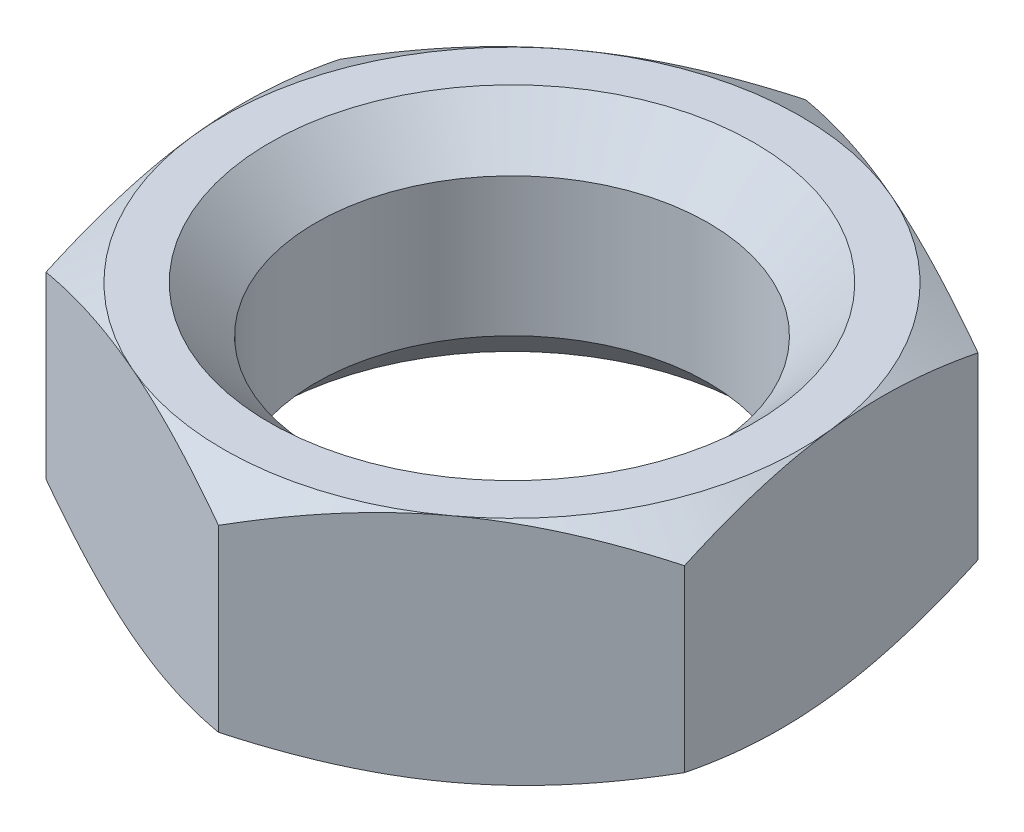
ISO-10303-21;
HEADER;
FILE_DESCRIPTION(('STEP AP214'),'2;1');
FILE_NAME('part.step','',(''),(''),'','','');
FILE_SCHEMA(('AUTOMOTIVE_DESIGN { 1 0 10303 214 1 1 1 1 }'));
ENDSEC;
DATA;
#1=APPLICATION_CONTEXT('core data for automotive mechanical design processes');
#2=APPLICATION_PROTOCOL_DEFINITION('international standard','automotive_design',2000,#1);
#3=PRODUCT_CONTEXT('',#1,'mechanical');
#4=PRODUCT('Part','Part','',(#3));
#5=PRODUCT_RELATED_PRODUCT_CATEGORY('part','',(#4));
#6=PRODUCT_DEFINITION_FORMATION('','',#4);
#7=PRODUCT_DEFINITION_CONTEXT('part definition',#1,'design');
#8=PRODUCT_DEFINITION('design','',#6,#7);
#9=PRODUCT_DEFINITION_SHAPE('','',#8);
#10=(LENGTH_UNIT() NAMED_UNIT(*) SI_UNIT(.MILLI.,.METRE.));
#11=(NAMED_UNIT(*) PLANE_ANGLE_UNIT() SI_UNIT($,.RADIAN.));
#12=(NAMED_UNIT(*) SI_UNIT($,.STERADIAN.) SOLID_ANGLE_UNIT());
#13=UNCERTAINTY_MEASURE_WITH_UNIT(LENGTH_MEASURE(1.E-05),#10,'distance_accuracy_value','');
#14=(GEOMETRIC_REPRESENTATION_CONTEXT(3) GLOBAL_UNCERTAINTY_ASSIGNED_CONTEXT((#13)) GLOBAL_UNIT_ASSIGNED_CONTEXT((#10,
#11,#12)) REPRESENTATION_CONTEXT('',''));
#15=CARTESIAN_POINT('',(0.,0.,0.));
#16=DIRECTION('',(0.,0.,1.));
#17=DIRECTION('',(1.,0.,0.));
#18=AXIS2_PLACEMENT_3D('',#15,#16,#17);
#19=CARTESIAN_POINT('',(-5.29341186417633,4.,-2.30502151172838));
#20=DIRECTION('',(0.993632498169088,0.,-0.112669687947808));
#21=DIRECTION('',(-0.112669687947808,0.,-0.993632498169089));
#22=AXIS2_PLACEMENT_3D('',#19,#20,#21);
#23=PLANE('',#22);
#24=CARTESIAN_POINT('',(-5.29343454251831,3.55335990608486,-2.30522151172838));
#25=CARTESIAN_POINT('',(-5.26484718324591,3.62662129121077,-2.05310996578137));
#26=CARTESIAN_POINT('',(-5.23601531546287,3.69325579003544,-1.79884210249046));
#27=CARTESIAN_POINT('',(-5.17785233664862,3.80956657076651,-1.28590355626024));
#28=CARTESIAN_POINT('',(-5.14852019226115,3.85920170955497,-1.02722376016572));
#29=CARTESIAN_POINT('',(-5.09021494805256,3.93645214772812,-0.513030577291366));
#30=CARTESIAN_POINT('',(-5.0612509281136,3.9645820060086,-0.257597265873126));
#31=CARTESIAN_POINT('',(-5.01770301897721,3.98980631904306,0.126451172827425));
#32=CARTESIAN_POINT('',(-5.00317711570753,3.99538740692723,0.254554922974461));
#33=CARTESIAN_POINT('',(-4.97411188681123,4.00079792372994,0.510880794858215));
#34=CARTESIAN_POINT('',(-4.95957256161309,4.00062753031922,0.639102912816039));
#35=CARTESIAN_POINT('',(-4.91973930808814,3.99224532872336,0.990391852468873));
#36=CARTESIAN_POINT('',(-4.89445858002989,3.97816904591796,1.21334226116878));
#37=CARTESIAN_POINT('',(-4.84406490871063,3.93353394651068,1.65776338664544));
#38=CARTESIAN_POINT('',(-4.81895214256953,3.90295987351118,1.87923254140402));
#39=CARTESIAN_POINT('',(-4.76845694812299,3.82653289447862,2.32454899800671));
#40=CARTESIAN_POINT('',(-4.74308089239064,3.78035615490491,2.54834010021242));
#41=CARTESIAN_POINT('',(-4.69270721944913,3.67555346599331,2.99258486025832));
#42=CARTESIAN_POINT('',(-4.66770895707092,3.61695213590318,3.21304420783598));
#43=CARTESIAN_POINT('',(-4.64289043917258,3.55335990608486,3.43191839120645));
#44=B_SPLINE_CURVE_WITH_KNOTS('',3,(#24,#25,#26,#27,#28,#29,#30,#31,#32,#33,#34,#35,#36,#37,#38,
#39,#40,#41,#42,#43),.UNSPECIFIED.,.F.,.F.,(4,2,2,2,2,2,2,2,2,4),(0.,0.792553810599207,
1.58701248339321,2.36180942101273,2.74883389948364,3.13584642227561,3.80960273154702,
4.48398317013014,5.17332088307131,5.86130523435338),.UNSPECIFIED.);
#45=CARTESIAN_POINT('',(-5.29341186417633,3.55341801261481,-2.30502151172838));
#46=VERTEX_POINT('',#45);
#47=CARTESIAN_POINT('',(-4.96816249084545,4.,0.563348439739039));
#48=VERTEX_POINT('',#47);
#49=EDGE_CURVE('E767',#46,#48,#44,.T.);
#50=ORIENTED_EDGE('',*,*,#49,.F.);
#51=DIRECTION('',(0.,-1.,0.));
#52=VECTOR('',#51,1.);
#53=CARTESIAN_POINT('',(-5.29341186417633,4.,-2.30502151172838));
#54=LINE('',#53,#52);
#55=CARTESIAN_POINT('',(-5.29341186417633,0.446581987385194,-2.30502151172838));
#56=VERTEX_POINT('',#55);
#57=EDGE_CURVE('E548',#46,#56,#54,.T.);
#58=ORIENTED_EDGE('',*,*,#57,.T.);
#59=CARTESIAN_POINT('',(-4.64289043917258,0.446640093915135,3.43191839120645));
#60=CARTESIAN_POINT('',(-4.67147779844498,0.373378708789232,3.17980684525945));
#61=CARTESIAN_POINT('',(-4.70030966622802,0.306744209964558,2.92553898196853));
#62=CARTESIAN_POINT('',(-4.75847264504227,0.190433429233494,2.41260043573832));
#63=CARTESIAN_POINT('',(-4.78780478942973,0.140798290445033,2.15392063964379));
#64=CARTESIAN_POINT('',(-4.84611003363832,0.0635478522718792,1.63972745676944));
#65=CARTESIAN_POINT('',(-4.87507405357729,0.0354179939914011,1.3842941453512));
#66=CARTESIAN_POINT('',(-4.91862196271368,0.0101936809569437,1.00024570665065));
#67=CARTESIAN_POINT('',(-4.93314786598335,0.00461259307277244,0.872141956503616));
#68=CARTESIAN_POINT('',(-4.96221309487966,-0.0007979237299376,0.615816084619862));
#69=CARTESIAN_POINT('',(-4.97675242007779,-0.000627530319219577,0.487593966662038));
#70=CARTESIAN_POINT('',(-5.01658567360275,0.0077546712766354,0.136305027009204));
#71=CARTESIAN_POINT('',(-5.041866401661,0.0218309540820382,-0.0866453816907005));
#72=CARTESIAN_POINT('',(-5.09226007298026,0.0664660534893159,-0.531066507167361));
#73=CARTESIAN_POINT('',(-5.11737283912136,0.0970401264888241,-0.752535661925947));
#74=CARTESIAN_POINT('',(-5.16786803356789,0.173467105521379,-1.19785211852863));
#75=CARTESIAN_POINT('',(-5.19324408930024,0.219643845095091,-1.42164322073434));
#76=CARTESIAN_POINT('',(-5.24361776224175,0.324446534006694,-1.86588798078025));
#77=CARTESIAN_POINT('',(-5.26861602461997,0.38304786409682,-2.08634732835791));
#78=CARTESIAN_POINT('',(-5.29343454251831,0.446640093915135,-2.30522151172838));
#79=B_SPLINE_CURVE_WITH_KNOTS('',3,(#59,#60,#61,#62,#63,#64,#65,#66,#67,#68,#69,#70,#71,#72,#73,
#74,#75,#76,#77,#78),.UNSPECIFIED.,.F.,.F.,(4,2,2,2,2,2,2,2,2,4),(0.,0.792553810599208,
1.58701248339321,2.36180942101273,2.74883389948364,3.13584642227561,3.80960273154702,
4.48398317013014,5.17332088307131,5.86130523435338),.UNSPECIFIED.);
#80=CARTESIAN_POINT('',(-4.96816249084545,0.,0.563348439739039));
#81=VERTEX_POINT('',#80);
#82=EDGE_CURVE('E594',#81,#56,#79,.T.);
#83=ORIENTED_EDGE('',*,*,#82,.F.);
#84=CARTESIAN_POINT('',(-4.64291311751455,0.446581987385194,3.43171839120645));
#85=VERTEX_POINT('',#84);
#86=EDGE_CURVE('E597',#85,#81,#79,.T.);
#87=ORIENTED_EDGE('',*,*,#86,.F.);
#88=DIRECTION('',(0.,-1.,0.));
#89=VECTOR('',#88,1.);
#90=CARTESIAN_POINT('',(-4.64291311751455,4.,3.43171839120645));
#91=LINE('',#90,#89);
#92=CARTESIAN_POINT('',(-4.64291311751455,3.5534180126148,3.43171839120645));
#93=VERTEX_POINT('',#92);
#94=EDGE_CURVE('E557',#93,#85,#91,.T.);
#95=ORIENTED_EDGE('',*,*,#94,.F.);
#96=EDGE_CURVE('E514',#48,#93,#44,.T.);
#97=ORIENTED_EDGE('',*,*,#96,.F.);
#98=EDGE_LOOP('',(#50,#58,#83,#87,#95,#97));
#99=FACE_BOUND('',#98,.T.);
#100=ADVANCED_FACE('F351',(#99),#23,.F.);
#101=CARTESIAN_POINT('',(-4.64291311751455,4.,3.43171839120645));
#102=DIRECTION('',(0.399241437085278,0.,-0.916845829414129));
#103=DIRECTION('',(-0.916845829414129,0.,-0.399241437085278));
#104=AXIS2_PLACEMENT_3D('',#101,#102,#103);
#105=PLANE('',#104);
#106=CARTESIAN_POINT('',(-4.64311311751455,3.55335503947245,3.43163130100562));
#107=CARTESIAN_POINT('',(-4.41048417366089,3.62661682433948,3.53292980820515));
#108=CARTESIAN_POINT('',(-4.17586554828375,3.69325174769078,3.63509472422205));
#109=CARTESIAN_POINT('',(-3.70256569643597,3.80956340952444,3.84119361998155));
#110=CARTESIAN_POINT('',(-3.46387606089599,3.85919900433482,3.94513126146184));
#111=CARTESIAN_POINT('',(-2.98941851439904,3.93645034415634,4.15173427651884));
#112=CARTESIAN_POINT('',(-2.75372449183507,3.96458065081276,4.25436747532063));
#113=CARTESIAN_POINT('',(-2.39935439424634,3.98980561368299,4.40867829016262));
#114=CARTESIAN_POINT('',(-2.28115019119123,3.99538691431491,4.46015042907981));
#115=CARTESIAN_POINT('',(-2.04463255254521,4.00079784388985,4.56314227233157));
#116=CARTESIAN_POINT('',(-1.9263191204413,4.00062765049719,4.61466197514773));
#117=CARTESIAN_POINT('',(-1.6021748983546,3.99224591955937,4.75581090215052));
#118=CARTESIAN_POINT('',(-1.39645151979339,3.97816971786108,4.84539335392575));
#119=CARTESIAN_POINT('',(-0.986370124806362,3.93353439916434,5.02396370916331));
#120=CARTESIAN_POINT('',(-0.782013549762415,3.90296002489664,5.11295098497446));
#121=CARTESIAN_POINT('',(-0.371105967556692,3.82653210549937,5.29188110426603));
#122=CARTESIAN_POINT('',(-0.164606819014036,3.7803547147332,5.38180136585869));
#123=CARTESIAN_POINT('',(0.245311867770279,3.67555047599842,5.56030086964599));
#124=CARTESIAN_POINT('',(0.448736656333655,3.61694824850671,5.6488823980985));
#125=CARTESIAN_POINT('',(0.650698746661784,3.55335503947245,5.73682699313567));
#126=B_SPLINE_CURVE_WITH_KNOTS('',3,(#106,#107,#108,#109,#110,#111,#112,#113,#114,#115,#116,
#117,#118,#119,#120,#121,#122,#123,#124,#125),.UNSPECIFIED.,.F.,.F.,(4,2,2,2,2,2,2,2,2,4),(0.,
0.792554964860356,1.58701482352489,2.36181280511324,2.74883779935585,3.13585083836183,
3.80961460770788,4.48400253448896,5.17334813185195,5.86134031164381),.UNSPECIFIED.);
#127=CARTESIAN_POINT('',(-1.99620718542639,4.,4.58422914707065));
#128=VERTEX_POINT('',#127);
#129=EDGE_CURVE('E513',#93,#128,#126,.T.);
#130=ORIENTED_EDGE('',*,*,#129,.F.);
#131=ORIENTED_EDGE('',*,*,#94,.T.);
#132=CARTESIAN_POINT('',(0.650698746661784,0.446644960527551,5.73682699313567));
#133=CARTESIAN_POINT('',(0.418069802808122,0.373383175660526,5.63552848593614));
#134=CARTESIAN_POINT('',(0.183451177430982,0.306748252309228,5.53336356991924));
#135=CARTESIAN_POINT('',(-0.289848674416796,0.190436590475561,5.32726467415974));
#136=CARTESIAN_POINT('',(-0.528538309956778,0.140800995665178,5.22332703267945));
#137=CARTESIAN_POINT('',(-1.00299585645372,0.0635496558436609,5.01672401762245));
#138=CARTESIAN_POINT('',(-1.2386898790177,0.0354193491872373,4.91409081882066));
#139=CARTESIAN_POINT('',(-1.59305997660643,0.0101943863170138,4.75978000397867));
#140=CARTESIAN_POINT('',(-1.71126417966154,0.00461308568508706,4.70830786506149));
#141=CARTESIAN_POINT('',(-1.94778181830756,-0.000797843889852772,4.60531602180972));
#142=CARTESIAN_POINT('',(-2.06609525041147,-0.000627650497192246,4.55379631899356));
#143=CARTESIAN_POINT('',(-2.39023947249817,0.00775408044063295,4.41264739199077));
#144=CARTESIAN_POINT('',(-2.59596285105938,0.0218302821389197,4.32306494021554));
#145=CARTESIAN_POINT('',(-3.00604424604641,0.0664656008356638,4.14449458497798));
#146=CARTESIAN_POINT('',(-3.21040082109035,0.0970399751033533,4.05550730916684));
#147=CARTESIAN_POINT('',(-3.62130840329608,0.173467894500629,3.87657718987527));
#148=CARTESIAN_POINT('',(-3.82780755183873,0.219645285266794,3.78665692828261));
#149=CARTESIAN_POINT('',(-4.23772623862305,0.324449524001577,3.6081574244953));
#150=CARTESIAN_POINT('',(-4.44115102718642,0.383051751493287,3.5195758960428));
#151=CARTESIAN_POINT('',(-4.64311311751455,0.446644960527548,3.43163130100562));
#152=B_SPLINE_CURVE_WITH_KNOTS('',3,(#132,#133,#134,#135,#136,#137,#138,#139,#140,#141,#142,
#143,#144,#145,#146,#147,#148,#149,#150,#151),.UNSPECIFIED.,.F.,.F.,(4,2,2,2,2,2,2,2,2,4),(0.,
0.792554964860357,1.58701482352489,2.36181280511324,2.74883779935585,3.13585083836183,
3.80961460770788,4.48400253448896,5.17334813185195,5.86134031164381),.UNSPECIFIED.);
#153=CARTESIAN_POINT('',(-1.99620718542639,0.,4.58422914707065));
#154=VERTEX_POINT('',#153);
#155=EDGE_CURVE('E527',#154,#85,#152,.T.);
#156=ORIENTED_EDGE('',*,*,#155,.F.);
#157=CARTESIAN_POINT('',(0.650498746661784,0.446581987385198,5.73673990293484));
#158=VERTEX_POINT('',#157);
#159=EDGE_CURVE('E534',#158,#154,#152,.T.);
#160=ORIENTED_EDGE('',*,*,#159,.F.);
#161=DIRECTION('',(0.,-1.,0.));
#162=VECTOR('',#161,1.);
#163=CARTESIAN_POINT('',(0.650498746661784,4.,5.73673990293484));
#164=LINE('',#163,#162);
#165=CARTESIAN_POINT('',(0.650498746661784,3.5534180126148,5.73673990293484));
#166=VERTEX_POINT('',#165);
#167=EDGE_CURVE('E555',#166,#158,#164,.T.);
#168=ORIENTED_EDGE('',*,*,#167,.F.);
#169=EDGE_CURVE('E509',#128,#166,#126,.T.);
#170=ORIENTED_EDGE('',*,*,#169,.F.);
#171=EDGE_LOOP('',(#130,#131,#156,#160,#168,#170));
#172=FACE_BOUND('',#171,.T.);
#173=ADVANCED_FACE('F519',(#172),#105,.F.);
#174=CARTESIAN_POINT('',(0.650498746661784,4.,5.73673990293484));
#175=DIRECTION('',(-0.594391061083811,0.,-0.804176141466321));
#176=DIRECTION('',(-0.804176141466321,0.,0.594391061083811));
#177=AXIS2_PLACEMENT_3D('',#174,#175,#176);
#178=PLANE('',#177);
#179=CARTESIAN_POINT('',(0.650298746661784,3.55334621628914,5.73688772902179));
#180=CARTESIAN_POINT('',(0.854340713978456,3.62660872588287,5.58607410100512));
#181=CARTESIAN_POINT('',(1.06012785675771,3.69324441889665,5.43397056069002));
#182=CARTESIAN_POINT('',(1.47526553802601,3.80955767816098,5.12712966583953));
#183=CARTESIAN_POINT('',(1.6846234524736,3.85919409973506,4.9723868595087));
#184=CARTESIAN_POINT('',(2.10077658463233,3.93644707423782,4.66479541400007));
#185=CARTESIAN_POINT('',(2.30750699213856,3.96457819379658,4.51199467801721));
#186=CARTESIAN_POINT('',(2.61832982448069,3.98980433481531,4.2822560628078));
#187=CARTESIAN_POINT('',(2.72200834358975,3.99538602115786,4.2056241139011));
#188=CARTESIAN_POINT('',(2.92946120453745,4.00079769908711,4.05228939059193));
#189=CARTESIAN_POINT('',(3.03323554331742,4.00062786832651,3.97558661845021));
#190=CARTESIAN_POINT('',(3.31755010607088,3.99224699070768,3.76544107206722));
#191=CARTESIAN_POINT('',(3.49799612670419,3.97817093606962,3.63206792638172));
#192=CARTESIAN_POINT('',(3.85769056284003,3.93353521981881,3.36620682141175));
#193=CARTESIAN_POINT('',(4.03693771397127,3.90296029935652,3.23371979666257));
#194=CARTESIAN_POINT('',(4.39735688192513,3.82653067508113,2.96732302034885));
#195=CARTESIAN_POINT('',(4.5784834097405,3.78035210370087,2.833446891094));
#196=CARTESIAN_POINT('',(4.93803517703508,3.67554505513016,2.5676912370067));
#197=CARTESIAN_POINT('',(5.11646502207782,3.61694120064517,2.43580830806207));
#198=CARTESIAN_POINT('',(5.29361186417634,3.55334621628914,2.30487368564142));
#199=B_SPLINE_CURVE_WITH_KNOTS('',3,(#179,#180,#181,#182,#183,#184,#185,#186,#187,#188,#189,
#190,#191,#192,#193,#194,#195,#196,#197,#198),.UNSPECIFIED.,.F.,.F.,(4,2,2,2,2,2,2,2,2,4),(0.,
0.792557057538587,1.58701906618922,2.3618189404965,2.74884486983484,3.13585884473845,
3.8096361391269,4.48403764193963,5.1733975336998,5.86140390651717),.UNSPECIFIED.);
#200=CARTESIAN_POINT('',(2.97195530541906,4.,4.02088070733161));
#201=VERTEX_POINT('',#200);
#202=EDGE_CURVE('E374',#166,#201,#199,.T.);
#203=ORIENTED_EDGE('',*,*,#202,.F.);
#204=ORIENTED_EDGE('',*,*,#167,.T.);
#205=CARTESIAN_POINT('',(5.29361186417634,0.44665378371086,2.30487368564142));
#206=CARTESIAN_POINT('',(5.08956989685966,0.373391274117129,2.4556873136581));
#207=CARTESIAN_POINT('',(4.88378275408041,0.306755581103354,2.6077908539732));
#208=CARTESIAN_POINT('',(4.46864507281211,0.190442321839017,2.91463174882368));
#209=CARTESIAN_POINT('',(4.25928715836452,0.140805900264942,3.06937455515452));
#210=CARTESIAN_POINT('',(3.84313402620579,0.063552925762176,3.37696600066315));
#211=CARTESIAN_POINT('',(3.63640361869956,0.0354218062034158,3.52976673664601));
#212=CARTESIAN_POINT('',(3.32558078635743,0.0101956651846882,3.75950535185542));
#213=CARTESIAN_POINT('',(3.22190226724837,0.00461397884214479,3.83613730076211));
#214=CARTESIAN_POINT('',(3.01444940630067,-0.000797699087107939,3.98947202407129));
#215=CARTESIAN_POINT('',(2.9106750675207,-0.000627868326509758,4.066174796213));
#216=CARTESIAN_POINT('',(2.62636050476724,0.00775300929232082,4.276320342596));
#217=CARTESIAN_POINT('',(2.44591448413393,0.0218290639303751,4.40969348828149));
#218=CARTESIAN_POINT('',(2.08622004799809,0.0664647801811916,4.67555459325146));
#219=CARTESIAN_POINT('',(1.90697289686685,0.097039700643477,4.80804161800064));
#220=CARTESIAN_POINT('',(1.54655372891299,0.173469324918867,5.07443839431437));
#221=CARTESIAN_POINT('',(1.36542720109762,0.219647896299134,5.20831452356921));
#222=CARTESIAN_POINT('',(1.00587543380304,0.324454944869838,5.47407017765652));
#223=CARTESIAN_POINT('',(0.827445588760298,0.383058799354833,5.60595310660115));
#224=CARTESIAN_POINT('',(0.650298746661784,0.446653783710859,5.73688772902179));
#225=B_SPLINE_CURVE_WITH_KNOTS('',3,(#205,#206,#207,#208,#209,#210,#211,#212,#213,#214,#215,
#216,#217,#218,#219,#220,#221,#222,#223,#224),.UNSPECIFIED.,.F.,.F.,(4,2,2,2,2,2,2,2,2,4),(0.,
0.792557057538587,1.58701906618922,2.3618189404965,2.74884486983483,3.13585884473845,
3.8096361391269,4.48403764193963,5.1733975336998,5.86140390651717),.UNSPECIFIED.);
#226=CARTESIAN_POINT('',(2.97195530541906,0.,4.02088070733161));
#227=VERTEX_POINT('',#226);
#228=EDGE_CURVE('E540',#227,#158,#225,.T.);
#229=ORIENTED_EDGE('',*,*,#228,.F.);
#230=CARTESIAN_POINT('',(5.29341186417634,0.446581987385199,2.30502151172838));
#231=VERTEX_POINT('',#230);
#232=EDGE_CURVE('E546',#231,#227,#225,.T.);
#233=ORIENTED_EDGE('',*,*,#232,.F.);
#234=DIRECTION('',(0.,-1.,0.));
#235=VECTOR('',#234,1.);
#236=CARTESIAN_POINT('',(5.29341186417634,4.,2.30502151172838));
#237=LINE('',#236,#235);
#238=CARTESIAN_POINT('',(5.29341186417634,3.5534180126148,2.30502151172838));
#239=VERTEX_POINT('',#238);
#240=EDGE_CURVE('E553',#239,#231,#237,.T.);
#241=ORIENTED_EDGE('',*,*,#240,.F.);
#242=EDGE_CURVE('E503',#201,#239,#199,.T.);
#243=ORIENTED_EDGE('',*,*,#242,.F.);
#244=EDGE_LOOP('',(#203,#204,#229,#233,#241,#243));
#245=FACE_BOUND('',#244,.T.);
#246=ADVANCED_FACE('F522',(#245),#178,.F.);
#247=CARTESIAN_POINT('',(5.29341186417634,4.,2.30502151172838));
#248=DIRECTION('',(-0.993632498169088,0.,0.112669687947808));
#249=DIRECTION('',(0.112669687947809,0.,0.993632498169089));
#250=AXIS2_PLACEMENT_3D('',#247,#248,#249);
#251=PLANE('',#250);
#252=CARTESIAN_POINT('',(5.29343454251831,3.55335990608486,2.30522151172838));
#253=CARTESIAN_POINT('',(5.26484718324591,3.62662129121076,2.05310996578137));
#254=CARTESIAN_POINT('',(5.23601531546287,3.69325579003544,1.79884210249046));
#255=CARTESIAN_POINT('',(5.17785233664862,3.8095665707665,1.28590355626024));
#256=CARTESIAN_POINT('',(5.14852019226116,3.85920170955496,1.02722376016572));
#257=CARTESIAN_POINT('',(5.09021494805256,3.93645214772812,0.513030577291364));
#258=CARTESIAN_POINT('',(5.0612509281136,3.9645820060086,0.257597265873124));
#259=CARTESIAN_POINT('',(5.01770301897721,3.98980631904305,-0.126451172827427));
#260=CARTESIAN_POINT('',(5.00317711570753,3.99538740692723,-0.254554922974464));
#261=CARTESIAN_POINT('',(4.97411188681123,4.00079792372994,-0.510880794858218));
#262=CARTESIAN_POINT('',(4.95957256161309,4.00062753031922,-0.639102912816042));
#263=CARTESIAN_POINT('',(4.91973930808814,3.99224532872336,-0.990391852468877));
#264=CARTESIAN_POINT('',(4.89445858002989,3.97816904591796,-1.21334226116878));
#265=CARTESIAN_POINT('',(4.84406490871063,3.93353394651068,-1.65776338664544));
#266=CARTESIAN_POINT('',(4.81895214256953,3.90295987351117,-1.87923254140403));
#267=CARTESIAN_POINT('',(4.76845694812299,3.82653289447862,-2.32454899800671));
#268=CARTESIAN_POINT('',(4.74308089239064,3.78035615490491,-2.54834010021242));
#269=CARTESIAN_POINT('',(4.69270721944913,3.6755534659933,-2.99258486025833));
#270=CARTESIAN_POINT('',(4.66770895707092,3.61695213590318,-3.21304420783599));
#271=CARTESIAN_POINT('',(4.64289043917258,3.55335990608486,-3.43191839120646));
#272=B_SPLINE_CURVE_WITH_KNOTS('',3,(#252,#253,#254,#255,#256,#257,#258,#259,#260,#261,#262,
#263,#264,#265,#266,#267,#268,#269,#270,#271),.UNSPECIFIED.,.F.,.F.,(4,2,2,2,2,2,2,2,2,4),(0.,
0.792553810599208,1.58701248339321,2.36180942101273,2.74883389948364,3.13584642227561,
3.80960273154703,4.48398317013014,5.17332088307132,5.86130523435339),.UNSPECIFIED.);
#273=CARTESIAN_POINT('',(4.96816249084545,4.,-0.563348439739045));
#274=VERTEX_POINT('',#273);
#275=EDGE_CURVE('E366',#239,#274,#272,.T.);
#276=ORIENTED_EDGE('',*,*,#275,.F.);
#277=ORIENTED_EDGE('',*,*,#240,.T.);
#278=CARTESIAN_POINT('',(4.64289043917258,0.446640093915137,-3.43191839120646));
#279=CARTESIAN_POINT('',(4.67147779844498,0.373378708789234,-3.17980684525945));
#280=CARTESIAN_POINT('',(4.70030966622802,0.30674420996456,-2.92553898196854));
#281=CARTESIAN_POINT('',(4.75847264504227,0.190433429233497,-2.41260043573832));
#282=CARTESIAN_POINT('',(4.78780478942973,0.140798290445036,-2.1539206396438));
#283=CARTESIAN_POINT('',(4.84611003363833,0.0635478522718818,-1.63972745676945));
#284=CARTESIAN_POINT('',(4.87507405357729,0.0354179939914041,-1.38429414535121));
#285=CARTESIAN_POINT('',(4.91862196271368,0.0101936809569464,-1.00024570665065));
#286=CARTESIAN_POINT('',(4.93314786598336,0.00461259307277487,-0.872141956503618));
#287=CARTESIAN_POINT('',(4.96221309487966,-0.000797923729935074,-0.615816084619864));
#288=CARTESIAN_POINT('',(4.9767524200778,-0.000627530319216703,-0.48759396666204));
#289=CARTESIAN_POINT('',(5.01658567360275,0.00775467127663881,-0.136305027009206));
#290=CARTESIAN_POINT('',(5.041866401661,0.0218309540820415,0.0866453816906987));
#291=CARTESIAN_POINT('',(5.09226007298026,0.0664660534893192,0.53106650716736));
#292=CARTESIAN_POINT('',(5.11737283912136,0.0970401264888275,0.752535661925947));
#293=CARTESIAN_POINT('',(5.1678680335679,0.173467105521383,1.19785211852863));
#294=CARTESIAN_POINT('',(5.19324408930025,0.219643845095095,1.42164322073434));
#295=CARTESIAN_POINT('',(5.24361776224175,0.324446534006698,1.86588798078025));
#296=CARTESIAN_POINT('',(5.26861602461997,0.383047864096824,2.08634732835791));
#297=CARTESIAN_POINT('',(5.29343454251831,0.446640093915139,2.30522151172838));
#298=B_SPLINE_CURVE_WITH_KNOTS('',3,(#278,#279,#280,#281,#282,#283,#284,#285,#286,#287,#288,
#289,#290,#291,#292,#293,#294,#295,#296,#297),.UNSPECIFIED.,.F.,.F.,(4,2,2,2,2,2,2,2,2,4),(0.,
0.792553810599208,1.58701248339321,2.36180942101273,2.74883389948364,3.13584642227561,
3.80960273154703,4.48398317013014,5.17332088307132,5.86130523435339),.UNSPECIFIED.);
#299=CARTESIAN_POINT('',(4.96816249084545,0.,-0.563348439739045));
#300=VERTEX_POINT('',#299);
#301=EDGE_CURVE('E547',#300,#231,#298,.T.);
#302=ORIENTED_EDGE('',*,*,#301,.F.);
#303=CARTESIAN_POINT('',(4.64291311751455,0.446581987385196,-3.43171839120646));
#304=VERTEX_POINT('',#303);
#305=EDGE_CURVE('E535',#304,#300,#298,.T.);
#306=ORIENTED_EDGE('',*,*,#305,.F.);
#307=DIRECTION('',(0.,-1.,0.));
#308=VECTOR('',#307,1.);
#309=CARTESIAN_POINT('',(4.64291311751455,4.,-3.43171839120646));
#310=LINE('',#309,#308);
#311=CARTESIAN_POINT('',(4.64291311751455,3.5534180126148,-3.43171839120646));
#312=VERTEX_POINT('',#311);
#313=EDGE_CURVE('E551',#312,#304,#310,.T.);
#314=ORIENTED_EDGE('',*,*,#313,.F.);
#315=EDGE_CURVE('E447',#274,#312,#272,.T.);
#316=ORIENTED_EDGE('',*,*,#315,.F.);
#317=EDGE_LOOP('',(#276,#277,#302,#306,#314,#316));
#318=FACE_BOUND('',#317,.T.);
#319=ADVANCED_FACE('F664',(#318),#251,.F.);
#320=CARTESIAN_POINT('',(4.64291311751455,4.,-3.43171839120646));
#321=DIRECTION('',(-0.399241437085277,0.,0.916845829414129));
#322=DIRECTION('',(0.916845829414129,0.,0.399241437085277));
#323=AXIS2_PLACEMENT_3D('',#320,#321,#322);
#324=PLANE('',#323);
#325=CARTESIAN_POINT('',(4.64311311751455,3.55335503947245,-3.43163130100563));
#326=CARTESIAN_POINT('',(4.41048417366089,3.62661682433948,-3.53292980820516));
#327=CARTESIAN_POINT('',(4.17586554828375,3.69325174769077,-3.63509472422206));
#328=CARTESIAN_POINT('',(3.70256569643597,3.80956340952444,-3.84119361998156));
#329=CARTESIAN_POINT('',(3.46387606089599,3.85919900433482,-3.94513126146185));
#330=CARTESIAN_POINT('',(2.98941851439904,3.93645034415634,-4.15173427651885));
#331=CARTESIAN_POINT('',(2.75372449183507,3.96458065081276,-4.25436747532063));
#332=CARTESIAN_POINT('',(2.39935439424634,3.98980561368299,-4.40867829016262));
#333=CARTESIAN_POINT('',(2.28115019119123,3.99538691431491,-4.46015042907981));
#334=CARTESIAN_POINT('',(2.04463255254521,4.00079784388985,-4.56314227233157));
#335=CARTESIAN_POINT('',(1.9263191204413,4.00062765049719,-4.61466197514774));
#336=CARTESIAN_POINT('',(1.6021748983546,3.99224591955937,-4.75581090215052));
#337=CARTESIAN_POINT('',(1.39645151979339,3.97816971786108,-4.84539335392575));
#338=CARTESIAN_POINT('',(0.986370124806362,3.93353439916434,-5.02396370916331));
#339=CARTESIAN_POINT('',(0.782013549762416,3.90296002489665,-5.11295098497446));
#340=CARTESIAN_POINT('',(0.371105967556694,3.82653210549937,-5.29188110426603));
#341=CARTESIAN_POINT('',(0.164606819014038,3.7803547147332,-5.38180136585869));
#342=CARTESIAN_POINT('',(-0.245311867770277,3.67555047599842,-5.56030086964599));
#343=CARTESIAN_POINT('',(-0.448736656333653,3.61694824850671,-5.6488823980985));
#344=CARTESIAN_POINT('',(-0.650698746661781,3.55335503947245,-5.73682699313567));
#345=B_SPLINE_CURVE_WITH_KNOTS('',3,(#325,#326,#327,#328,#329,#330,#331,#332,#333,#334,#335,
#336,#337,#338,#339,#340,#341,#342,#343,#344),.UNSPECIFIED.,.F.,.F.,(4,2,2,2,2,2,2,2,2,4),(0.,
0.792554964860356,1.58701482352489,2.36181280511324,2.74883779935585,3.13585083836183,
3.80961460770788,4.48400253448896,5.17334813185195,5.86134031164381),.UNSPECIFIED.);
#346=CARTESIAN_POINT('',(1.99620718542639,4.,-4.58422914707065));
#347=VERTEX_POINT('',#346);
#348=EDGE_CURVE('E440',#312,#347,#345,.T.);
#349=ORIENTED_EDGE('',*,*,#348,.F.);
#350=ORIENTED_EDGE('',*,*,#313,.T.);
#351=CARTESIAN_POINT('',(-0.650698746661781,0.446644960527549,-5.73682699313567));
#352=CARTESIAN_POINT('',(-0.41806980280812,0.373383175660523,-5.63552848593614));
#353=CARTESIAN_POINT('',(-0.18345117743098,0.306748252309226,-5.53336356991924));
#354=CARTESIAN_POINT('',(0.289848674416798,0.190436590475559,-5.32726467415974));
#355=CARTESIAN_POINT('',(0.52853830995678,0.140800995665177,-5.22332703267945));
#356=CARTESIAN_POINT('',(1.00299585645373,0.0635496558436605,-5.01672401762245));
#357=CARTESIAN_POINT('',(1.2386898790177,0.0354193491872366,-4.91409081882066));
#358=CARTESIAN_POINT('',(1.59305997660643,0.0101943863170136,-4.75978000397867));
#359=CARTESIAN_POINT('',(1.71126417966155,0.00461308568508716,-4.70830786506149));
#360=CARTESIAN_POINT('',(1.94778181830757,-0.00079784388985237,-4.60531602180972));
#361=CARTESIAN_POINT('',(2.06609525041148,-0.000627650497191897,-4.55379631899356));
#362=CARTESIAN_POINT('',(2.39023947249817,0.00775408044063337,-4.41264739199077));
#363=CARTESIAN_POINT('',(2.59596285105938,0.0218302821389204,-4.32306494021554));
#364=CARTESIAN_POINT('',(3.00604424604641,0.066465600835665,-4.14449458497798));
#365=CARTESIAN_POINT('',(3.21040082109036,0.0970399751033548,-4.05550730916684));
#366=CARTESIAN_POINT('',(3.62130840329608,0.173467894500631,-3.87657718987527));
#367=CARTESIAN_POINT('',(3.82780755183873,0.219645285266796,-3.78665692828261));
#368=CARTESIAN_POINT('',(4.23772623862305,0.324449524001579,-3.60815742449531));
#369=CARTESIAN_POINT('',(4.44115102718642,0.383051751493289,-3.5195758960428));
#370=CARTESIAN_POINT('',(4.64311311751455,0.446644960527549,-3.43163130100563));
#371=B_SPLINE_CURVE_WITH_KNOTS('',3,(#351,#352,#353,#354,#355,#356,#357,#358,#359,#360,#361,
#362,#363,#364,#365,#366,#367,#368,#369,#370),.UNSPECIFIED.,.F.,.F.,(4,2,2,2,2,2,2,2,2,4),(0.,
0.792554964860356,1.58701482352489,2.36181280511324,2.74883779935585,3.13585083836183,
3.80961460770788,4.48400253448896,5.17334813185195,5.86134031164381),.UNSPECIFIED.);
#372=CARTESIAN_POINT('',(1.99620718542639,0.,-4.58422914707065));
#373=VERTEX_POINT('',#372);
#374=EDGE_CURVE('E603',#373,#304,#371,.T.);
#375=ORIENTED_EDGE('',*,*,#374,.F.);
#376=CARTESIAN_POINT('',(-0.650498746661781,0.446581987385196,-5.73673990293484));
#377=VERTEX_POINT('',#376);
#378=EDGE_CURVE('E602',#377,#373,#371,.T.);
#379=ORIENTED_EDGE('',*,*,#378,.F.);
#380=DIRECTION('',(0.,-1.,0.));
#381=VECTOR('',#380,1.);
#382=CARTESIAN_POINT('',(-0.650498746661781,4.,-5.73673990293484));
#383=LINE('',#382,#381);
#384=CARTESIAN_POINT('',(-0.650498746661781,3.5534180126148,-5.73673990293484));
#385=VERTEX_POINT('',#384);
#386=EDGE_CURVE('E470',#385,#377,#383,.T.);
#387=ORIENTED_EDGE('',*,*,#386,.F.);
#388=EDGE_CURVE('E451',#347,#385,#345,.T.);
#389=ORIENTED_EDGE('',*,*,#388,.F.);
#390=EDGE_LOOP('',(#349,#350,#375,#379,#387,#389));
#391=FACE_BOUND('',#390,.T.);
#392=ADVANCED_FACE('F468',(#391),#324,.F.);
#393=CARTESIAN_POINT('',(-0.650498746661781,4.,-5.73673990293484));
#394=DIRECTION('',(0.594391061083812,0.,0.804176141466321));
#395=DIRECTION('',(0.804176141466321,0.,-0.594391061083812));
#396=AXIS2_PLACEMENT_3D('',#393,#394,#395);
#397=PLANE('',#396);
#398=CARTESIAN_POINT('',(-0.650298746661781,3.55334621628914,-5.73688772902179));
#399=CARTESIAN_POINT('',(-0.854340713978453,3.62660872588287,-5.58607410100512));
#400=CARTESIAN_POINT('',(-1.06012785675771,3.69324441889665,-5.43397056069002));
#401=CARTESIAN_POINT('',(-1.47526553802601,3.80955767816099,-5.12712966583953));
#402=CARTESIAN_POINT('',(-1.6846234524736,3.85919409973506,-4.9723868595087));
#403=CARTESIAN_POINT('',(-2.10077658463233,3.93644707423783,-4.66479541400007));
#404=CARTESIAN_POINT('',(-2.30750699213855,3.96457819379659,-4.5119946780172));
#405=CARTESIAN_POINT('',(-2.61832982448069,3.98980433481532,-4.2822560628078));
#406=CARTESIAN_POINT('',(-2.72200834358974,3.99538602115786,-4.2056241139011));
#407=CARTESIAN_POINT('',(-2.92946120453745,4.00079769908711,-4.05228939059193));
#408=CARTESIAN_POINT('',(-3.03323554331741,4.00062786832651,-3.97558661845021));
#409=CARTESIAN_POINT('',(-3.31755010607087,3.99224699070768,-3.76544107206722));
#410=CARTESIAN_POINT('',(-3.49799612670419,3.97817093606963,-3.63206792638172));
#411=CARTESIAN_POINT('',(-3.85769056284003,3.93353521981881,-3.36620682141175));
#412=CARTESIAN_POINT('',(-4.03693771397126,3.90296029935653,-3.23371979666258));
#413=CARTESIAN_POINT('',(-4.39735688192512,3.82653067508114,-2.96732302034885));
#414=CARTESIAN_POINT('',(-4.5784834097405,3.78035210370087,-2.833446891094));
#415=CARTESIAN_POINT('',(-4.93803517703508,3.67554505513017,-2.5676912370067));
#416=CARTESIAN_POINT('',(-5.11646502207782,3.61694120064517,-2.43580830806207));
#417=CARTESIAN_POINT('',(-5.29361186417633,3.55334621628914,-2.30487368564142));
#418=B_SPLINE_CURVE_WITH_KNOTS('',3,(#398,#399,#400,#401,#402,#403,#404,#405,#406,#407,#408,
#409,#410,#411,#412,#413,#414,#415,#416,#417),.UNSPECIFIED.,.F.,.F.,(4,2,2,2,2,2,2,2,2,4),(0.,
0.792557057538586,1.58701906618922,2.3618189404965,2.74884486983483,3.13585884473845,
3.8096361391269,4.48403764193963,5.1733975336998,5.86140390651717),.UNSPECIFIED.);
#419=CARTESIAN_POINT('',(-2.97195530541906,4.,-4.02088070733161));
#420=VERTEX_POINT('',#419);
#421=EDGE_CURVE('E457',#385,#420,#418,.T.);
#422=ORIENTED_EDGE('',*,*,#421,.F.);
#423=ORIENTED_EDGE('',*,*,#386,.T.);
#424=CARTESIAN_POINT('',(-5.29361186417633,0.446653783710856,-2.30487368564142));
#425=CARTESIAN_POINT('',(-5.08956989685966,0.373391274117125,-2.4556873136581));
#426=CARTESIAN_POINT('',(-4.88378275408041,0.30675558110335,-2.6077908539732));
#427=CARTESIAN_POINT('',(-4.46864507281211,0.190442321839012,-2.91463174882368));
#428=CARTESIAN_POINT('',(-4.25928715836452,0.140805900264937,-3.06937455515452));
#429=CARTESIAN_POINT('',(-3.84313402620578,0.0635529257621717,-3.37696600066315));
#430=CARTESIAN_POINT('',(-3.63640361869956,0.0354218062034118,-3.52976673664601));
#431=CARTESIAN_POINT('',(-3.32558078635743,0.0101956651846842,-3.75950535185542));
#432=CARTESIAN_POINT('',(-3.22190226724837,0.00461397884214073,-3.83613730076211));
#433=CARTESIAN_POINT('',(-3.01444940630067,-0.000797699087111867,-3.98947202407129));
#434=CARTESIAN_POINT('',(-2.9106750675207,-0.00062786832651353,-4.066174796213));
#435=CARTESIAN_POINT('',(-2.62636050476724,0.00775300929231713,-4.276320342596));
#436=CARTESIAN_POINT('',(-2.44591448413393,0.0218290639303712,-4.40969348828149));
#437=CARTESIAN_POINT('',(-2.08622004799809,0.0664647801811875,-4.67555459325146));
#438=CARTESIAN_POINT('',(-1.90697289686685,0.0970397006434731,-4.80804161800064));
#439=CARTESIAN_POINT('',(-1.54655372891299,0.173469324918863,-5.07443839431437));
#440=CARTESIAN_POINT('',(-1.36542720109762,0.219647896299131,-5.20831452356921));
#441=CARTESIAN_POINT('',(-1.00587543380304,0.324454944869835,-5.47407017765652));
#442=CARTESIAN_POINT('',(-0.827445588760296,0.383058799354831,-5.60595310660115));
#443=CARTESIAN_POINT('',(-0.650298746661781,0.446653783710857,-5.73688772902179));
#444=B_SPLINE_CURVE_WITH_KNOTS('',3,(#424,#425,#426,#427,#428,#429,#430,#431,#432,#433,#434,
#435,#436,#437,#438,#439,#440,#441,#442,#443),.UNSPECIFIED.,.F.,.F.,(4,2,2,2,2,2,2,2,2,4),(0.,
0.792557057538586,1.58701906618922,2.3618189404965,2.74884486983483,3.13585884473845,
3.80963613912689,4.48403764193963,5.1733975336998,5.86140390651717),.UNSPECIFIED.);
#445=CARTESIAN_POINT('',(-2.97195530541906,0.,-4.02088070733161));
#446=VERTEX_POINT('',#445);
#447=EDGE_CURVE('E614',#446,#377,#444,.T.);
#448=ORIENTED_EDGE('',*,*,#447,.F.);
#449=EDGE_CURVE('E605',#56,#446,#444,.T.);
#450=ORIENTED_EDGE('',*,*,#449,.F.);
#451=ORIENTED_EDGE('',*,*,#57,.F.);
#452=EDGE_CURVE('E465',#420,#46,#418,.T.);
#453=ORIENTED_EDGE('',*,*,#452,.F.);
#454=EDGE_LOOP('',(#422,#423,#448,#450,#451,#453));
#455=FACE_BOUND('',#454,.T.);
#456=ADVANCED_FACE('F620',(#455),#397,.F.);
#457=CARTESIAN_POINT('',(-5.94391061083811,4.,-8.04176141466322));
#458=DIRECTION('',(0.,-1.,0.));
#459=DIRECTION('',(0.,0.,-1.));
#460=AXIS2_PLACEMENT_3D('',#457,#458,#459);
#461=PLANE('',#460);
#462=CARTESIAN_POINT('',(0.,4.,0.));
#463=DIRECTION('',(0.,-1.,0.));
#464=DIRECTION('',(0.,0.,-1.));
#465=AXIS2_PLACEMENT_3D('',#462,#463,#464);
#466=CIRCLE('',#465,4.19999999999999);
#467=CARTESIAN_POINT('',(0.,4.,-4.19999999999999));
#468=VERTEX_POINT('',#467);
#469=EDGE_CURVE('E568',#468,#468,#466,.T.);
#470=ORIENTED_EDGE('',*,*,#469,.T.);
#471=EDGE_LOOP('',(#470));
#472=FACE_BOUND('',#471,.T.);
#473=CARTESIAN_POINT('',(0.,4.,0.));
#474=DIRECTION('',(0.,-1.,0.));
#475=DIRECTION('',(0.,0.,-1.));
#476=AXIS2_PLACEMENT_3D('',#473,#474,#475);
#477=CIRCLE('',#476,5.00000000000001);
#478=EDGE_CURVE('E444',#347,#274,#477,.T.);
#479=ORIENTED_EDGE('',*,*,#478,.F.);
#480=CARTESIAN_POINT('',(0.,4.,0.));
#481=DIRECTION('',(0.,-1.,0.));
#482=DIRECTION('',(0.,0.,-1.));
#483=AXIS2_PLACEMENT_3D('',#480,#481,#482);
#484=CIRCLE('',#483,5.00000000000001);
#485=EDGE_CURVE('E355',#420,#347,#484,.T.);
#486=ORIENTED_EDGE('',*,*,#485,.F.);
#487=EDGE_CURVE('E461',#48,#420,#484,.T.);
#488=ORIENTED_EDGE('',*,*,#487,.F.);
#489=EDGE_CURVE('E772',#128,#48,#484,.T.);
#490=ORIENTED_EDGE('',*,*,#489,.F.);
#491=EDGE_CURVE('E360',#201,#128,#484,.T.);
#492=ORIENTED_EDGE('',*,*,#491,.F.);
#493=EDGE_CURVE('E11',#274,#201,#484,.T.);
#494=ORIENTED_EDGE('',*,*,#493,.F.);
#495=EDGE_LOOP('',(#479,#486,#488,#490,#492,#494));
#496=FACE_BOUND('',#495,.T.);
#497=ADVANCED_FACE('F463',(#472,#496),#461,.F.);
#498=CARTESIAN_POINT('',(-5.94391061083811,0.,-8.04176141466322));
#499=DIRECTION('',(0.,-1.,0.));
#500=DIRECTION('',(0.,0.,-1.));
#501=AXIS2_PLACEMENT_3D('',#498,#499,#500);
#502=PLANE('',#501);
#503=CARTESIAN_POINT('',(0.,0.,0.));
#504=DIRECTION('',(0.,-1.,0.));
#505=DIRECTION('',(0.,0.,-1.));
#506=AXIS2_PLACEMENT_3D('',#503,#504,#505);
#507=CIRCLE('',#506,4.2);
#508=CARTESIAN_POINT('',(0.,0.,-4.2));
#509=VERTEX_POINT('',#508);
#510=EDGE_CURVE('E559',#509,#509,#507,.F.);
#511=ORIENTED_EDGE('',*,*,#510,.T.);
#512=EDGE_LOOP('',(#511));
#513=FACE_BOUND('',#512,.T.);
#514=CARTESIAN_POINT('',(0.,0.,0.));
#515=DIRECTION('',(0.,-1.,0.));
#516=DIRECTION('',(0.,0.,-1.));
#517=AXIS2_PLACEMENT_3D('',#514,#515,#516);
#518=CIRCLE('',#517,5.00000000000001);
#519=EDGE_CURVE('E570',#446,#373,#518,.T.);
#520=ORIENTED_EDGE('',*,*,#519,.T.);
#521=CARTESIAN_POINT('',(0.,0.,0.));
#522=DIRECTION('',(0.,-1.,0.));
#523=DIRECTION('',(0.,0.,-1.));
#524=AXIS2_PLACEMENT_3D('',#521,#522,#523);
#525=CIRCLE('',#524,5.00000000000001);
#526=EDGE_CURVE('E619',#373,#300,#525,.T.);
#527=ORIENTED_EDGE('',*,*,#526,.T.);
#528=EDGE_CURVE('E462',#300,#227,#518,.T.);
#529=ORIENTED_EDGE('',*,*,#528,.T.);
#530=EDGE_CURVE('E579',#227,#154,#518,.T.);
#531=ORIENTED_EDGE('',*,*,#530,.T.);
#532=EDGE_CURVE('E577',#154,#81,#518,.T.);
#533=ORIENTED_EDGE('',*,*,#532,.T.);
#534=EDGE_CURVE('E572',#81,#446,#518,.T.);
#535=ORIENTED_EDGE('',*,*,#534,.T.);
#536=EDGE_LOOP('',(#520,#527,#529,#531,#533,#535));
#537=FACE_BOUND('',#536,.T.);
#538=ADVANCED_FACE('F588',(#513,#537),#502,.T.);
#539=CARTESIAN_POINT('',(0.,4.,0.));
#540=DIRECTION('',(0.,1.,0.));
#541=DIRECTION('',(0.,0.,1.));
#542=AXIS2_PLACEMENT_3D('',#539,#540,#541);
#543=CYLINDRICAL_SURFACE('',#542,3.39999999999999);
#544=CARTESIAN_POINT('',(0.,0.800000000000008,0.));
#545=DIRECTION('',(0.,-1.,0.));
#546=DIRECTION('',(0.,0.,-1.));
#547=AXIS2_PLACEMENT_3D('',#544,#545,#546);
#548=CIRCLE('',#547,3.39999999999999);
#549=CARTESIAN_POINT('',(0.,0.800000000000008,-3.4));
#550=VERTEX_POINT('',#549);
#551=EDGE_CURVE('E565',#550,#550,#548,.T.);
#552=ORIENTED_EDGE('',*,*,#551,.T.);
#553=EDGE_LOOP('',(#552));
#554=FACE_BOUND('',#553,.T.);
#555=CARTESIAN_POINT('',(0.,3.20000000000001,0.));
#556=DIRECTION('',(0.,-1.,0.));
#557=DIRECTION('',(0.,0.,-1.));
#558=AXIS2_PLACEMENT_3D('',#555,#556,#557);
#559=CIRCLE('',#558,3.39999999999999);
#560=CARTESIAN_POINT('',(0.,3.20000000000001,-3.4));
#561=VERTEX_POINT('',#560);
#562=EDGE_CURVE('E562',#561,#561,#559,.F.);
#563=ORIENTED_EDGE('',*,*,#562,.T.);
#564=EDGE_LOOP('',(#563));
#565=FACE_BOUND('',#564,.T.);
#566=ADVANCED_FACE('F631',(#554,#565),#543,.F.);
#567=CARTESIAN_POINT('',(0.,0.,0.));
#568=DIRECTION('',(0.,-1.,0.));
#569=DIRECTION('',(0.,0.,-1.));
#570=AXIS2_PLACEMENT_3D('',#567,#568,#569);
#571=CONICAL_SURFACE('',#570,4.2,0.785398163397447);
#572=ORIENTED_EDGE('',*,*,#551,.F.);
#573=EDGE_LOOP('',(#572));
#574=FACE_BOUND('',#573,.T.);
#575=ORIENTED_EDGE('',*,*,#510,.F.);
#576=EDGE_LOOP('',(#575));
#577=FACE_BOUND('',#576,.T.);
#578=ADVANCED_FACE('F635',(#574,#577),#571,.F.);
#579=CARTESIAN_POINT('',(0.,3.20000000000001,0.));
#580=DIRECTION('',(0.,1.,0.));
#581=DIRECTION('',(0.,0.,1.));
#582=AXIS2_PLACEMENT_3D('',#579,#580,#581);
#583=CONICAL_SURFACE('',#582,3.39999999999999,0.78539816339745);
#584=ORIENTED_EDGE('',*,*,#469,.F.);
#585=EDGE_LOOP('',(#584));
#586=FACE_BOUND('',#585,.T.);
#587=ORIENTED_EDGE('',*,*,#562,.F.);
#588=EDGE_LOOP('',(#587));
#589=FACE_BOUND('',#588,.T.);
#590=ADVANCED_FACE('F638',(#586,#589),#583,.F.);
#591=CARTESIAN_POINT('',(0.,0.,0.));
#592=DIRECTION('',(0.,1.,0.));
#593=DIRECTION('',(0.,0.,1.));
#594=AXIS2_PLACEMENT_3D('',#591,#592,#593);
#595=CONICAL_SURFACE('',#594,5.00000000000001,1.0471975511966);
#596=ORIENTED_EDGE('',*,*,#378,.T.);
#597=ORIENTED_EDGE('',*,*,#519,.F.);
#598=ORIENTED_EDGE('',*,*,#447,.T.);
#599=EDGE_LOOP('',(#596,#597,#598));
#600=FACE_BOUND('',#599,.T.);
#601=ADVANCED_FACE('F641',(#600),#595,.T.);
#602=ORIENTED_EDGE('',*,*,#82,.T.);
#603=ORIENTED_EDGE('',*,*,#449,.T.);
#604=ORIENTED_EDGE('',*,*,#534,.F.);
#605=EDGE_LOOP('',(#602,#603,#604));
#606=FACE_BOUND('',#605,.T.);
#607=ADVANCED_FACE('F647',(#606),#595,.T.);
#608=ORIENTED_EDGE('',*,*,#155,.T.);
#609=ORIENTED_EDGE('',*,*,#86,.T.);
#610=ORIENTED_EDGE('',*,*,#532,.F.);
#611=EDGE_LOOP('',(#608,#609,#610));
#612=FACE_BOUND('',#611,.T.);
#613=ADVANCED_FACE('F697',(#612),#595,.T.);
#614=ORIENTED_EDGE('',*,*,#228,.T.);
#615=ORIENTED_EDGE('',*,*,#159,.T.);
#616=ORIENTED_EDGE('',*,*,#530,.F.);
#617=EDGE_LOOP('',(#614,#615,#616));
#618=FACE_BOUND('',#617,.T.);
#619=ADVANCED_FACE('F704',(#618),#595,.T.);
#620=ORIENTED_EDGE('',*,*,#232,.T.);
#621=ORIENTED_EDGE('',*,*,#528,.F.);
#622=ORIENTED_EDGE('',*,*,#301,.T.);
#623=EDGE_LOOP('',(#620,#621,#622));
#624=FACE_BOUND('',#623,.T.);
#625=ADVANCED_FACE('F494',(#624),#595,.T.);
#626=ORIENTED_EDGE('',*,*,#305,.T.);
#627=ORIENTED_EDGE('',*,*,#526,.F.);
#628=ORIENTED_EDGE('',*,*,#374,.T.);
#629=EDGE_LOOP('',(#626,#627,#628));
#630=FACE_BOUND('',#629,.T.);
#631=ADVANCED_FACE('F698',(#630),#595,.T.);
#632=CARTESIAN_POINT('',(0.,2.84529946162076,0.));
#633=DIRECTION('',(0.,-1.,0.));
#634=DIRECTION('',(0.,0.,-1.));
#635=AXIS2_PLACEMENT_3D('',#632,#633,#634);
#636=CONICAL_SURFACE('',#635,7.,1.0471975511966);
#637=ORIENTED_EDGE('',*,*,#388,.T.);
#638=ORIENTED_EDGE('',*,*,#421,.T.);
#639=ORIENTED_EDGE('',*,*,#485,.T.);
#640=EDGE_LOOP('',(#637,#638,#639));
#641=FACE_BOUND('',#640,.T.);
#642=ADVANCED_FACE('F455',(#641),#636,.T.);
#643=ORIENTED_EDGE('',*,*,#49,.T.);
#644=ORIENTED_EDGE('',*,*,#487,.T.);
#645=ORIENTED_EDGE('',*,*,#452,.T.);
#646=EDGE_LOOP('',(#643,#644,#645));
#647=FACE_BOUND('',#646,.T.);
#648=ADVANCED_FACE('F488',(#647),#636,.T.);
#649=ORIENTED_EDGE('',*,*,#96,.T.);
#650=ORIENTED_EDGE('',*,*,#129,.T.);
#651=ORIENTED_EDGE('',*,*,#489,.T.);
#652=EDGE_LOOP('',(#649,#650,#651));
#653=FACE_BOUND('',#652,.T.);
#654=ADVANCED_FACE('F492',(#653),#636,.T.);
#655=ORIENTED_EDGE('',*,*,#169,.T.);
#656=ORIENTED_EDGE('',*,*,#202,.T.);
#657=ORIENTED_EDGE('',*,*,#491,.T.);
#658=EDGE_LOOP('',(#655,#656,#657));
#659=FACE_BOUND('',#658,.T.);
#660=ADVANCED_FACE('F737',(#659),#636,.T.);
#661=ORIENTED_EDGE('',*,*,#242,.T.);
#662=ORIENTED_EDGE('',*,*,#275,.T.);
#663=ORIENTED_EDGE('',*,*,#493,.T.);
#664=EDGE_LOOP('',(#661,#662,#663));
#665=FACE_BOUND('',#664,.T.);
#666=ADVANCED_FACE('F744',(#665),#636,.T.);
#667=ORIENTED_EDGE('',*,*,#315,.T.);
#668=ORIENTED_EDGE('',*,*,#348,.T.);
#669=ORIENTED_EDGE('',*,*,#478,.T.);
#670=EDGE_LOOP('',(#667,#668,#669));
#671=FACE_BOUND('',#670,.T.);
#672=ADVANCED_FACE('F442',(#671),#636,.T.);
#673=CLOSED_SHELL('',(#100,#173,#246,#319,#392,#456,#497,#538,#566,#578,#590,#601,#607,#613,
#619,#625,#631,#642,#648,#654,#660,#666,#672));
#674=MANIFOLD_SOLID_BREP('B2',#673);
#675=ADVANCED_BREP_SHAPE_REPRESENTATION('',(#18,#674),#14);
#676=SHAPE_DEFINITION_REPRESENTATION(#9,#675);
ENDSEC;
END-ISO-10303-21;
